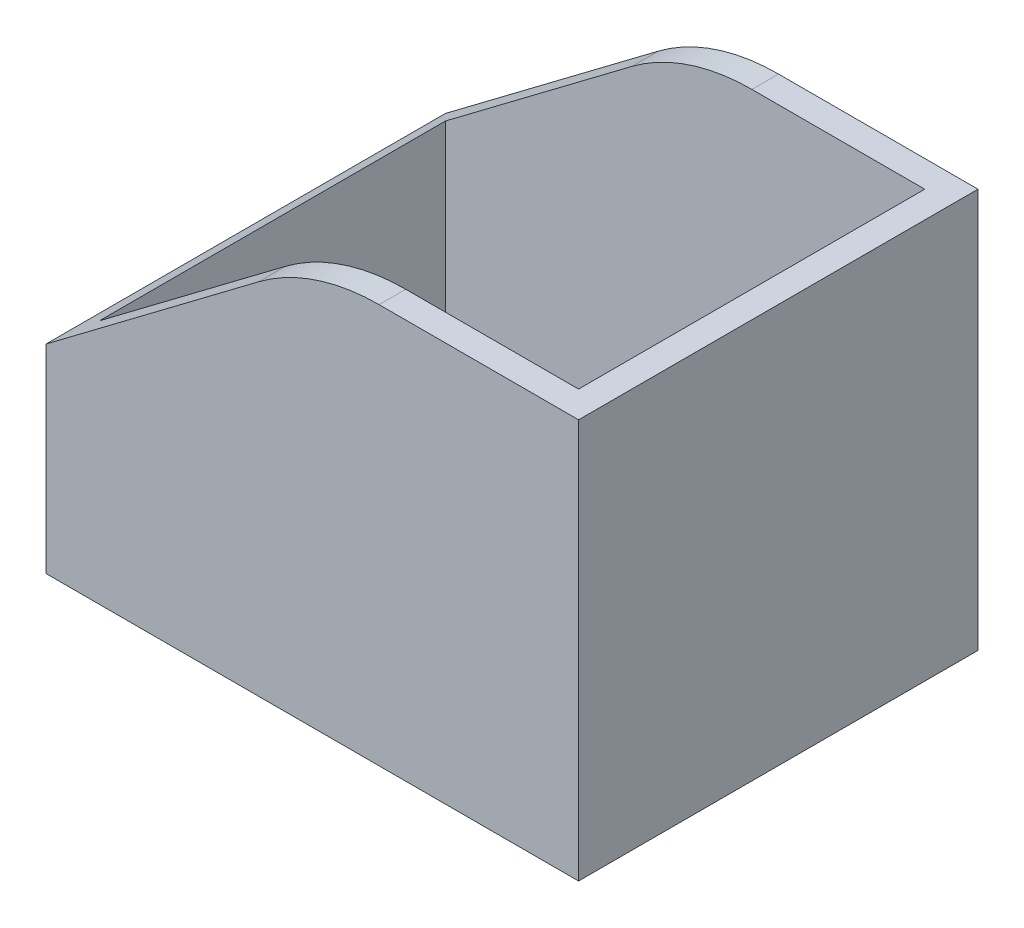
ISO-10303-21;
HEADER;
FILE_DESCRIPTION(('STEP AP214'),'2;1');
FILE_NAME('part.step','',(''),(''),'','','');
FILE_SCHEMA(('AUTOMOTIVE_DESIGN { 1 0 10303 214 1 1 1 1 }'));
ENDSEC;
DATA;
#1=APPLICATION_CONTEXT('core data for automotive mechanical design processes');
#2=APPLICATION_PROTOCOL_DEFINITION('international standard','automotive_design',2000,#1);
#3=PRODUCT_CONTEXT('',#1,'mechanical');
#4=PRODUCT('Part','Part','',(#3));
#5=PRODUCT_RELATED_PRODUCT_CATEGORY('part','',(#4));
#6=PRODUCT_DEFINITION_FORMATION('','',#4);
#7=PRODUCT_DEFINITION_CONTEXT('part definition',#1,'design');
#8=PRODUCT_DEFINITION('design','',#6,#7);
#9=PRODUCT_DEFINITION_SHAPE('','',#8);
#10=(LENGTH_UNIT() NAMED_UNIT(*) SI_UNIT(.MILLI.,.METRE.));
#11=(NAMED_UNIT(*) PLANE_ANGLE_UNIT() SI_UNIT($,.RADIAN.));
#12=(NAMED_UNIT(*) SI_UNIT($,.STERADIAN.) SOLID_ANGLE_UNIT());
#13=UNCERTAINTY_MEASURE_WITH_UNIT(LENGTH_MEASURE(1.E-05),#10,'distance_accuracy_value','');
#14=(GEOMETRIC_REPRESENTATION_CONTEXT(3) GLOBAL_UNCERTAINTY_ASSIGNED_CONTEXT((#13)) GLOBAL_UNIT_ASSIGNED_CONTEXT((#10,
#11,#12)) REPRESENTATION_CONTEXT('',''));
#15=CARTESIAN_POINT('',(0.,0.,0.));
#16=DIRECTION('',(0.,0.,1.));
#17=DIRECTION('',(1.,0.,0.));
#18=AXIS2_PLACEMENT_3D('',#15,#16,#17);
#19=CARTESIAN_POINT('',(0.,60.,60.));
#20=DIRECTION('',(0.,-1.,0.));
#21=DIRECTION('',(0.,0.,-1.));
#22=AXIS2_PLACEMENT_3D('',#19,#20,#21);
#23=PLANE('',#22);
#24=DIRECTION('',(-1.,0.,0.));
#25=VECTOR('',#24,1.);
#26=CARTESIAN_POINT('',(0.,60.,56.));
#27=LINE('',#26,#25);
#28=CARTESIAN_POINT('',(76.,60.,56.));
#29=VERTEX_POINT('',#28);
#30=CARTESIAN_POINT('',(50.0378595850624,60.,56.));
#31=VERTEX_POINT('',#30);
#32=EDGE_CURVE('E157',#29,#31,#27,.T.);
#33=ORIENTED_EDGE('',*,*,#32,.T.);
#34=DIRECTION('',(0.,0.,-1.));
#35=VECTOR('',#34,1.);
#36=CARTESIAN_POINT('',(50.0378595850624,60.,60.));
#37=LINE('',#36,#35);
#38=CARTESIAN_POINT('',(50.0378595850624,60.,60.));
#39=VERTEX_POINT('',#38);
#40=EDGE_CURVE('E204',#31,#39,#37,.F.);
#41=ORIENTED_EDGE('',*,*,#40,.T.);
#42=DIRECTION('',(-1.,0.,0.));
#43=VECTOR('',#42,1.);
#44=CARTESIAN_POINT('',(0.,60.,60.));
#45=LINE('',#44,#43);
#46=CARTESIAN_POINT('',(80.,60.,60.));
#47=VERTEX_POINT('',#46);
#48=EDGE_CURVE('E175',#47,#39,#45,.T.);
#49=ORIENTED_EDGE('',*,*,#48,.F.);
#50=DIRECTION('',(0.,0.,-1.));
#51=VECTOR('',#50,1.);
#52=CARTESIAN_POINT('',(80.,60.,60.));
#53=LINE('',#52,#51);
#54=CARTESIAN_POINT('',(80.,60.,0.));
#55=VERTEX_POINT('',#54);
#56=EDGE_CURVE('E178',#47,#55,#53,.T.);
#57=ORIENTED_EDGE('',*,*,#56,.T.);
#58=DIRECTION('',(-1.,0.,0.));
#59=VECTOR('',#58,1.);
#60=CARTESIAN_POINT('',(0.,60.,0.));
#61=LINE('',#60,#59);
#62=CARTESIAN_POINT('',(50.0378595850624,60.,0.));
#63=VERTEX_POINT('',#62);
#64=EDGE_CURVE('E171',#55,#63,#61,.T.);
#65=ORIENTED_EDGE('',*,*,#64,.T.);
#66=DIRECTION('',(0.,0.,-1.));
#67=VECTOR('',#66,1.);
#68=CARTESIAN_POINT('',(50.0378595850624,60.,4.));
#69=LINE('',#68,#67);
#70=CARTESIAN_POINT('',(50.0378595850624,60.,4.));
#71=VERTEX_POINT('',#70);
#72=EDGE_CURVE('E201',#63,#71,#69,.F.);
#73=ORIENTED_EDGE('',*,*,#72,.T.);
#74=DIRECTION('',(-1.,0.,0.));
#75=VECTOR('',#74,1.);
#76=CARTESIAN_POINT('',(0.,60.,4.));
#77=LINE('',#76,#75);
#78=CARTESIAN_POINT('',(76.,60.,4.));
#79=VERTEX_POINT('',#78);
#80=EDGE_CURVE('E132',#79,#71,#77,.T.);
#81=ORIENTED_EDGE('',*,*,#80,.F.);
#82=DIRECTION('',(0.,0.,-1.));
#83=VECTOR('',#82,1.);
#84=CARTESIAN_POINT('',(76.,60.,60.));
#85=LINE('',#84,#83);
#86=EDGE_CURVE('E149',#29,#79,#85,.T.);
#87=ORIENTED_EDGE('',*,*,#86,.F.);
#88=EDGE_LOOP('',(#33,#41,#49,#57,#65,#73,#81,#87));
#89=FACE_BOUND('',#88,.T.);
#90=ADVANCED_FACE('F33',(#89),#23,.F.);
#91=CARTESIAN_POINT('',(0.,29.8578379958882,60.));
#92=DIRECTION('',(0.601815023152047,-0.798635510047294,0.));
#93=DIRECTION('',(0.,0.,-1.));
#94=AXIS2_PLACEMENT_3D('',#91,#92,#93);
#95=PLANE('',#94);
#96=DIRECTION('',(0.798635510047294,0.601815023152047,0.));
#97=VECTOR('',#96,1.);
#98=CARTESIAN_POINT('',(0.,29.8578379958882,60.));
#99=LINE('',#98,#97);
#100=CARTESIAN_POINT('',(31.983408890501,53.9590653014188,60.));
#101=VERTEX_POINT('',#100);
#102=CARTESIAN_POINT('',(0.,29.8578379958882,60.));
#103=VERTEX_POINT('',#102);
#104=EDGE_CURVE('E199',#101,#103,#99,.F.);
#105=ORIENTED_EDGE('',*,*,#104,.F.);
#106=DIRECTION('',(0.,0.,1.));
#107=VECTOR('',#106,1.);
#108=CARTESIAN_POINT('',(31.983408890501,53.9590653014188,56.));
#109=LINE('',#108,#107);
#110=CARTESIAN_POINT('',(31.983408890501,53.9590653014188,56.));
#111=VERTEX_POINT('',#110);
#112=EDGE_CURVE('E210',#101,#111,#109,.F.);
#113=ORIENTED_EDGE('',*,*,#112,.T.);
#114=DIRECTION('',(0.798635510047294,0.601815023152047,0.));
#115=VECTOR('',#114,1.);
#116=CARTESIAN_POINT('',(0.,29.8578379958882,56.));
#117=LINE('',#116,#115);
#118=CARTESIAN_POINT('',(4.,32.8720541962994,56.));
#119=VERTEX_POINT('',#118);
#120=EDGE_CURVE('E159',#111,#119,#117,.F.);
#121=ORIENTED_EDGE('',*,*,#120,.T.);
#122=DIRECTION('',(0.,0.,1.));
#123=VECTOR('',#122,1.);
#124=CARTESIAN_POINT('',(4.,32.8720541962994,60.));
#125=LINE('',#124,#123);
#126=CARTESIAN_POINT('',(4.,32.8720541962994,4.));
#127=VERTEX_POINT('',#126);
#128=EDGE_CURVE('E128',#119,#127,#125,.F.);
#129=ORIENTED_EDGE('',*,*,#128,.T.);
#130=DIRECTION('',(-0.798635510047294,-0.601815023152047,0.));
#131=VECTOR('',#130,1.);
#132=CARTESIAN_POINT('',(-14.3505979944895,19.0438867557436,4.));
#133=LINE('',#132,#131);
#134=CARTESIAN_POINT('',(31.983408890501,53.9590653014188,4.));
#135=VERTEX_POINT('',#134);
#136=EDGE_CURVE('E147',#127,#135,#133,.F.);
#137=ORIENTED_EDGE('',*,*,#136,.T.);
#138=DIRECTION('',(0.,0.,1.));
#139=VECTOR('',#138,1.);
#140=CARTESIAN_POINT('',(31.983408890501,53.9590653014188,0.));
#141=LINE('',#140,#139);
#142=CARTESIAN_POINT('',(31.983408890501,53.9590653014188,0.));
#143=VERTEX_POINT('',#142);
#144=EDGE_CURVE('E48',#135,#143,#141,.F.);
#145=ORIENTED_EDGE('',*,*,#144,.T.);
#146=DIRECTION('',(-0.798635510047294,-0.601815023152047,0.));
#147=VECTOR('',#146,1.);
#148=CARTESIAN_POINT('',(-14.3505979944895,19.0438867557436,0.));
#149=LINE('',#148,#147);
#150=CARTESIAN_POINT('',(0.,29.8578379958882,0.));
#151=VERTEX_POINT('',#150);
#152=EDGE_CURVE('E197',#151,#143,#149,.F.);
#153=ORIENTED_EDGE('',*,*,#152,.F.);
#154=DIRECTION('',(0.,0.,-1.));
#155=VECTOR('',#154,1.);
#156=CARTESIAN_POINT('',(0.,29.8578379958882,60.));
#157=LINE('',#156,#155);
#158=EDGE_CURVE('E194',#103,#151,#157,.T.);
#159=ORIENTED_EDGE('',*,*,#158,.F.);
#160=EDGE_LOOP('',(#105,#113,#121,#129,#137,#145,#153,#159));
#161=FACE_BOUND('',#160,.T.);
#162=ADVANCED_FACE('F227',(#161),#95,.F.);
#163=CARTESIAN_POINT('',(0.,0.,60.));
#164=DIRECTION('',(1.,0.,0.));
#165=DIRECTION('',(0.,0.,-1.));
#166=AXIS2_PLACEMENT_3D('',#163,#164,#165);
#167=PLANE('',#166);
#168=DIRECTION('',(0.,-1.,0.));
#169=VECTOR('',#168,1.);
#170=CARTESIAN_POINT('',(0.,0.,60.));
#171=LINE('',#170,#169);
#172=CARTESIAN_POINT('',(0.,0.,60.));
#173=VERTEX_POINT('',#172);
#174=EDGE_CURVE('E168',#103,#173,#171,.T.);
#175=ORIENTED_EDGE('',*,*,#174,.F.);
#176=ORIENTED_EDGE('',*,*,#158,.T.);
#177=DIRECTION('',(0.,-1.,0.));
#178=VECTOR('',#177,1.);
#179=CARTESIAN_POINT('',(0.,0.,0.));
#180=LINE('',#179,#178);
#181=CARTESIAN_POINT('',(0.,0.,0.));
#182=VERTEX_POINT('',#181);
#183=EDGE_CURVE('E161',#151,#182,#180,.T.);
#184=ORIENTED_EDGE('',*,*,#183,.T.);
#185=DIRECTION('',(0.,0.,-1.));
#186=VECTOR('',#185,1.);
#187=CARTESIAN_POINT('',(0.,0.,60.));
#188=LINE('',#187,#186);
#189=EDGE_CURVE('E191',#173,#182,#188,.T.);
#190=ORIENTED_EDGE('',*,*,#189,.F.);
#191=EDGE_LOOP('',(#175,#176,#184,#190));
#192=FACE_BOUND('',#191,.T.);
#193=ADVANCED_FACE('F230',(#192),#167,.F.);
#194=CARTESIAN_POINT('',(0.,0.,60.));
#195=DIRECTION('',(0.,1.,0.));
#196=DIRECTION('',(0.,0.,1.));
#197=AXIS2_PLACEMENT_3D('',#194,#195,#196);
#198=PLANE('',#197);
#199=DIRECTION('',(1.,0.,0.));
#200=VECTOR('',#199,1.);
#201=CARTESIAN_POINT('',(0.,0.,0.));
#202=LINE('',#201,#200);
#203=CARTESIAN_POINT('',(80.,0.,0.));
#204=VERTEX_POINT('',#203);
#205=EDGE_CURVE('E180',#182,#204,#202,.T.);
#206=ORIENTED_EDGE('',*,*,#205,.T.);
#207=DIRECTION('',(0.,0.,-1.));
#208=VECTOR('',#207,1.);
#209=CARTESIAN_POINT('',(80.,0.,60.));
#210=LINE('',#209,#208);
#211=CARTESIAN_POINT('',(80.,0.,60.));
#212=VERTEX_POINT('',#211);
#213=EDGE_CURVE('E188',#212,#204,#210,.T.);
#214=ORIENTED_EDGE('',*,*,#213,.F.);
#215=DIRECTION('',(1.,0.,0.));
#216=VECTOR('',#215,1.);
#217=CARTESIAN_POINT('',(0.,0.,60.));
#218=LINE('',#217,#216);
#219=EDGE_CURVE('E170',#173,#212,#218,.T.);
#220=ORIENTED_EDGE('',*,*,#219,.F.);
#221=ORIENTED_EDGE('',*,*,#189,.T.);
#222=EDGE_LOOP('',(#206,#214,#220,#221));
#223=FACE_BOUND('',#222,.T.);
#224=ADVANCED_FACE('F241',(#223),#198,.F.);
#225=CARTESIAN_POINT('',(80.,0.,60.));
#226=DIRECTION('',(-1.,0.,0.));
#227=DIRECTION('',(0.,0.,1.));
#228=AXIS2_PLACEMENT_3D('',#225,#226,#227);
#229=PLANE('',#228);
#230=DIRECTION('',(0.,1.,0.));
#231=VECTOR('',#230,1.);
#232=CARTESIAN_POINT('',(80.,0.,0.));
#233=LINE('',#232,#231);
#234=EDGE_CURVE('E182',#204,#55,#233,.T.);
#235=ORIENTED_EDGE('',*,*,#234,.T.);
#236=ORIENTED_EDGE('',*,*,#56,.F.);
#237=DIRECTION('',(0.,1.,0.));
#238=VECTOR('',#237,1.);
#239=CARTESIAN_POINT('',(80.,0.,60.));
#240=LINE('',#239,#238);
#241=EDGE_CURVE('E173',#212,#47,#240,.T.);
#242=ORIENTED_EDGE('',*,*,#241,.F.);
#243=ORIENTED_EDGE('',*,*,#213,.T.);
#244=EDGE_LOOP('',(#235,#236,#242,#243));
#245=FACE_BOUND('',#244,.T.);
#246=ADVANCED_FACE('F245',(#245),#229,.F.);
#247=CARTESIAN_POINT('',(0.,0.,60.));
#248=DIRECTION('',(0.,0.,-1.));
#249=DIRECTION('',(-1.,0.,0.));
#250=AXIS2_PLACEMENT_3D('',#247,#248,#249);
#251=PLANE('',#250);
#252=ORIENTED_EDGE('',*,*,#48,.T.);
#253=CARTESIAN_POINT('',(50.0378595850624,30.,60.));
#254=DIRECTION('',(0.,0.,-1.));
#255=DIRECTION('',(-1.,0.,0.));
#256=AXIS2_PLACEMENT_3D('',#253,#254,#255);
#257=CIRCLE('',#256,30.);
#258=EDGE_CURVE('E207',#39,#101,#257,.F.);
#259=ORIENTED_EDGE('',*,*,#258,.T.);
#260=ORIENTED_EDGE('',*,*,#104,.T.);
#261=ORIENTED_EDGE('',*,*,#174,.T.);
#262=ORIENTED_EDGE('',*,*,#219,.T.);
#263=ORIENTED_EDGE('',*,*,#241,.T.);
#264=EDGE_LOOP('',(#252,#259,#260,#261,#262,#263));
#265=FACE_BOUND('',#264,.T.);
#266=ADVANCED_FACE('F224',(#265),#251,.F.);
#267=CARTESIAN_POINT('',(0.,0.,0.));
#268=DIRECTION('',(0.,0.,-1.));
#269=DIRECTION('',(-1.,0.,0.));
#270=AXIS2_PLACEMENT_3D('',#267,#268,#269);
#271=PLANE('',#270);
#272=ORIENTED_EDGE('',*,*,#152,.T.);
#273=CARTESIAN_POINT('',(50.0378595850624,30.,0.));
#274=DIRECTION('',(0.,0.,-1.));
#275=DIRECTION('',(-1.,0.,0.));
#276=AXIS2_PLACEMENT_3D('',#273,#274,#275);
#277=CIRCLE('',#276,30.);
#278=EDGE_CURVE('E11',#143,#63,#277,.T.);
#279=ORIENTED_EDGE('',*,*,#278,.T.);
#280=ORIENTED_EDGE('',*,*,#64,.F.);
#281=ORIENTED_EDGE('',*,*,#234,.F.);
#282=ORIENTED_EDGE('',*,*,#205,.F.);
#283=ORIENTED_EDGE('',*,*,#183,.F.);
#284=EDGE_LOOP('',(#272,#279,#280,#281,#282,#283));
#285=FACE_BOUND('',#284,.T.);
#286=ADVANCED_FACE('F234',(#285),#271,.T.);
#287=CARTESIAN_POINT('',(4.,0.,60.));
#288=DIRECTION('',(1.,0.,0.));
#289=DIRECTION('',(0.,0.,-1.));
#290=AXIS2_PLACEMENT_3D('',#287,#288,#289);
#291=PLANE('',#290);
#292=DIRECTION('',(0.,-1.,0.));
#293=VECTOR('',#292,1.);
#294=CARTESIAN_POINT('',(4.,0.,56.));
#295=LINE('',#294,#293);
#296=CARTESIAN_POINT('',(4.,4.,56.));
#297=VERTEX_POINT('',#296);
#298=EDGE_CURVE('E122',#119,#297,#295,.T.);
#299=ORIENTED_EDGE('',*,*,#298,.T.);
#300=DIRECTION('',(0.,0.,-1.));
#301=VECTOR('',#300,1.);
#302=CARTESIAN_POINT('',(4.,4.,60.));
#303=LINE('',#302,#301);
#304=CARTESIAN_POINT('',(4.,4.,4.));
#305=VERTEX_POINT('',#304);
#306=EDGE_CURVE('E126',#297,#305,#303,.T.);
#307=ORIENTED_EDGE('',*,*,#306,.T.);
#308=DIRECTION('',(0.,-1.,0.));
#309=VECTOR('',#308,1.);
#310=CARTESIAN_POINT('',(4.,0.,4.));
#311=LINE('',#310,#309);
#312=EDGE_CURVE('E153',#127,#305,#311,.T.);
#313=ORIENTED_EDGE('',*,*,#312,.F.);
#314=ORIENTED_EDGE('',*,*,#128,.F.);
#315=EDGE_LOOP('',(#299,#307,#313,#314));
#316=FACE_BOUND('',#315,.T.);
#317=ADVANCED_FACE('F124',(#316),#291,.T.);
#318=CARTESIAN_POINT('',(0.,4.,60.));
#319=DIRECTION('',(0.,1.,0.));
#320=DIRECTION('',(0.,0.,1.));
#321=AXIS2_PLACEMENT_3D('',#318,#319,#320);
#322=PLANE('',#321);
#323=DIRECTION('',(1.,0.,0.));
#324=VECTOR('',#323,1.);
#325=CARTESIAN_POINT('',(0.,4.,4.));
#326=LINE('',#325,#324);
#327=CARTESIAN_POINT('',(76.,4.,4.));
#328=VERTEX_POINT('',#327);
#329=EDGE_CURVE('E144',#305,#328,#326,.T.);
#330=ORIENTED_EDGE('',*,*,#329,.F.);
#331=ORIENTED_EDGE('',*,*,#306,.F.);
#332=DIRECTION('',(1.,0.,0.));
#333=VECTOR('',#332,1.);
#334=CARTESIAN_POINT('',(0.,4.,56.));
#335=LINE('',#334,#333);
#336=CARTESIAN_POINT('',(76.,4.,56.));
#337=VERTEX_POINT('',#336);
#338=EDGE_CURVE('E131',#297,#337,#335,.T.);
#339=ORIENTED_EDGE('',*,*,#338,.T.);
#340=DIRECTION('',(0.,0.,-1.));
#341=VECTOR('',#340,1.);
#342=CARTESIAN_POINT('',(76.,4.,60.));
#343=LINE('',#342,#341);
#344=EDGE_CURVE('E145',#337,#328,#343,.T.);
#345=ORIENTED_EDGE('',*,*,#344,.T.);
#346=EDGE_LOOP('',(#330,#331,#339,#345));
#347=FACE_BOUND('',#346,.T.);
#348=ADVANCED_FACE('F143',(#347),#322,.T.);
#349=CARTESIAN_POINT('',(76.,0.,60.));
#350=DIRECTION('',(-1.,0.,0.));
#351=DIRECTION('',(0.,0.,1.));
#352=AXIS2_PLACEMENT_3D('',#349,#350,#351);
#353=PLANE('',#352);
#354=DIRECTION('',(0.,1.,0.));
#355=VECTOR('',#354,1.);
#356=CARTESIAN_POINT('',(76.,0.,4.));
#357=LINE('',#356,#355);
#358=EDGE_CURVE('E154',#328,#79,#357,.T.);
#359=ORIENTED_EDGE('',*,*,#358,.F.);
#360=ORIENTED_EDGE('',*,*,#344,.F.);
#361=DIRECTION('',(0.,1.,0.));
#362=VECTOR('',#361,1.);
#363=CARTESIAN_POINT('',(76.,0.,56.));
#364=LINE('',#363,#362);
#365=EDGE_CURVE('E137',#337,#29,#364,.T.);
#366=ORIENTED_EDGE('',*,*,#365,.T.);
#367=ORIENTED_EDGE('',*,*,#86,.T.);
#368=EDGE_LOOP('',(#359,#360,#366,#367));
#369=FACE_BOUND('',#368,.T.);
#370=ADVANCED_FACE('F251',(#369),#353,.T.);
#371=CARTESIAN_POINT('',(0.,0.,56.));
#372=DIRECTION('',(0.,0.,-1.));
#373=DIRECTION('',(-1.,0.,0.));
#374=AXIS2_PLACEMENT_3D('',#371,#372,#373);
#375=PLANE('',#374);
#376=ORIENTED_EDGE('',*,*,#120,.F.);
#377=CARTESIAN_POINT('',(50.0378595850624,30.,56.));
#378=DIRECTION('',(0.,0.,-1.));
#379=DIRECTION('',(-1.,0.,0.));
#380=AXIS2_PLACEMENT_3D('',#377,#378,#379);
#381=CIRCLE('',#380,30.);
#382=EDGE_CURVE('E212',#111,#31,#381,.T.);
#383=ORIENTED_EDGE('',*,*,#382,.T.);
#384=ORIENTED_EDGE('',*,*,#32,.F.);
#385=ORIENTED_EDGE('',*,*,#365,.F.);
#386=ORIENTED_EDGE('',*,*,#338,.F.);
#387=ORIENTED_EDGE('',*,*,#298,.F.);
#388=EDGE_LOOP('',(#376,#383,#384,#385,#386,#387));
#389=FACE_BOUND('',#388,.T.);
#390=ADVANCED_FACE('F135',(#389),#375,.T.);
#391=CARTESIAN_POINT('',(0.,0.,4.));
#392=DIRECTION('',(0.,0.,-1.));
#393=DIRECTION('',(-1.,0.,0.));
#394=AXIS2_PLACEMENT_3D('',#391,#392,#393);
#395=PLANE('',#394);
#396=ORIENTED_EDGE('',*,*,#80,.T.);
#397=CARTESIAN_POINT('',(50.0378595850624,30.,4.));
#398=DIRECTION('',(0.,0.,-1.));
#399=DIRECTION('',(-1.,0.,0.));
#400=AXIS2_PLACEMENT_3D('',#397,#398,#399);
#401=CIRCLE('',#400,30.);
#402=EDGE_CURVE('E41',#71,#135,#401,.F.);
#403=ORIENTED_EDGE('',*,*,#402,.T.);
#404=ORIENTED_EDGE('',*,*,#136,.F.);
#405=ORIENTED_EDGE('',*,*,#312,.T.);
#406=ORIENTED_EDGE('',*,*,#329,.T.);
#407=ORIENTED_EDGE('',*,*,#358,.T.);
#408=EDGE_LOOP('',(#396,#403,#404,#405,#406,#407));
#409=FACE_BOUND('',#408,.T.);
#410=ADVANCED_FACE('F248',(#409),#395,.F.);
#411=CARTESIAN_POINT('',(50.0378595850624,30.,60.));
#412=DIRECTION('',(0.,0.,1.));
#413=DIRECTION('',(1.,0.,0.));
#414=AXIS2_PLACEMENT_3D('',#411,#412,#413);
#415=CYLINDRICAL_SURFACE('',#414,30.);
#416=ORIENTED_EDGE('',*,*,#382,.F.);
#417=ORIENTED_EDGE('',*,*,#112,.F.);
#418=ORIENTED_EDGE('',*,*,#258,.F.);
#419=ORIENTED_EDGE('',*,*,#40,.F.);
#420=EDGE_LOOP('',(#416,#417,#418,#419));
#421=FACE_BOUND('',#420,.T.);
#422=ADVANCED_FACE('F221',(#421),#415,.T.);
#423=CARTESIAN_POINT('',(50.0378595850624,30.,60.));
#424=DIRECTION('',(0.,0.,1.));
#425=DIRECTION('',(1.,0.,0.));
#426=AXIS2_PLACEMENT_3D('',#423,#424,#425);
#427=CYLINDRICAL_SURFACE('',#426,30.);
#428=ORIENTED_EDGE('',*,*,#278,.F.);
#429=ORIENTED_EDGE('',*,*,#144,.F.);
#430=ORIENTED_EDGE('',*,*,#402,.F.);
#431=ORIENTED_EDGE('',*,*,#72,.F.);
#432=EDGE_LOOP('',(#428,#429,#430,#431));
#433=FACE_BOUND('',#432,.T.);
#434=ADVANCED_FACE('F35',(#433),#427,.T.);
#435=CLOSED_SHELL('',(#90,#162,#193,#224,#246,#266,#286,#317,#348,#370,#390,#410,#422,#434));
#436=MANIFOLD_SOLID_BREP('B2',#435);
#437=ADVANCED_BREP_SHAPE_REPRESENTATION('',(#18,#436),#14);
#438=SHAPE_DEFINITION_REPRESENTATION(#9,#437);
ENDSEC;
END-ISO-10303-21;
